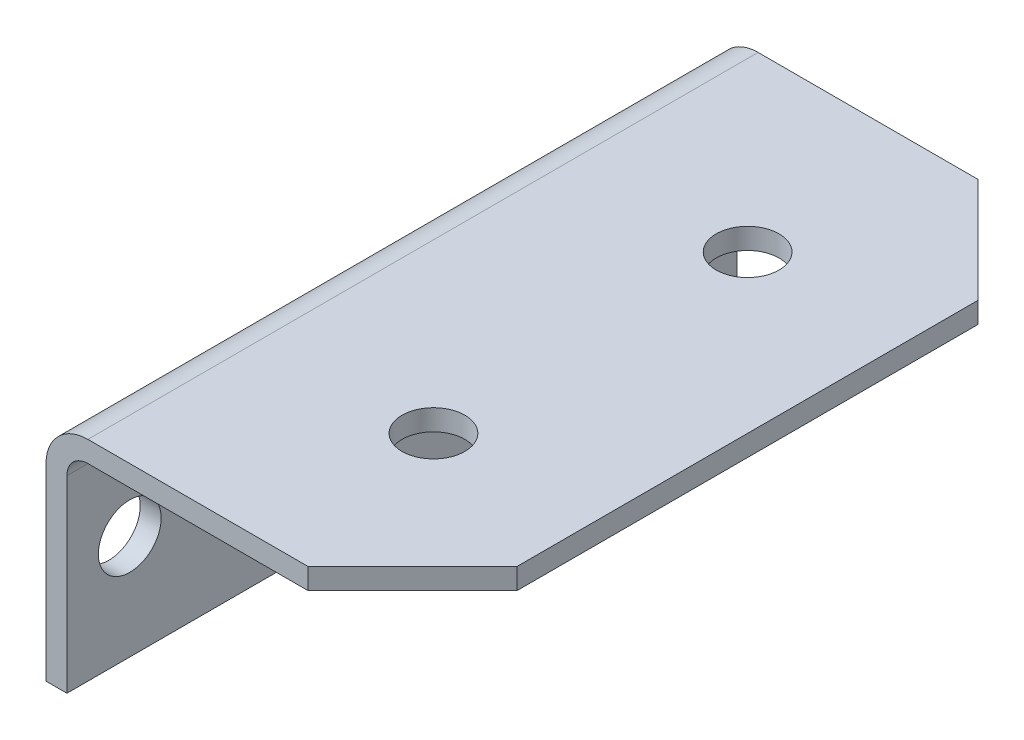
from build123d import *

# Parameters (mm, degrees)
EXTRUSION1_DEPTH        = 64
CONG_1_R                = 2
CONG_2_R                = 4
ESQUISSE2_R             = 3
ENL_V_MAT_EXTRU_1_DEPTH = 10
ESQUISSE3_R             = 3
ENL_V_MAT_EXTRU_2_DEPTH = 10
CHANFREIN1_SIZE         = 10


with BuildPart() as part:
    # Esquisse1 → Extrusion1 (new body)
    with BuildSketch(Plane.XY):
        Polygon((0, 0), (0, 22), (35, 22), (35, 20), (2, 20), (2, 0), align=None)
    extrude(amount=EXTRUSION1_DEPTH)

    # Cong_1
    cong_1_edges = [part.edges().sort_by_distance(p)[0] for p in [
        (2, 20, 32),
    ]]
    fillet(cong_1_edges, radius=CONG_1_R)

    # Cong_2
    cong_2_edges = [part.edges().sort_by_distance(p)[0] for p in [
        (0, 22, 32),
    ]]
    fillet(cong_2_edges, radius=CONG_2_R)

    # Esquisse2 → Enl_v. mat.-Extru.1 (cut)
    with BuildSketch(Plane(origin=(2, 0, 0), x_dir=(0, 0, -1), z_dir=(1, 0, 0))):
        with Locations(Location((-58, 10, 0), (0, 0, 90))):
            Circle(ESQUISSE2_R)
        with Locations(Location((-6, 10, 0), (0, 0, 90))):
            Circle(ESQUISSE2_R)
    extrude(amount=-ENL_V_MAT_EXTRU_1_DEPTH, mode=Mode.SUBTRACT)

    # Esquisse3 → Enl_v. mat.-Extru.2 (cut)
    with BuildSketch(Plane(origin=(0, 22, 0), x_dir=(-1, 0, 0), z_dir=(0, 1, 0))):
        with Locations(Location((-20, 17, 0), (0, 0, 90))):
            Circle(ESQUISSE3_R)
        with Locations(Location((-20, 47, 0), (0, 0, 90))):
            Circle(ESQUISSE3_R)
    extrude(amount=-ENL_V_MAT_EXTRU_2_DEPTH, mode=Mode.SUBTRACT)

    # Chanfrein1
    chanfrein1_edges = [part.edges().sort_by_distance(p)[0] for p in [
        (35, 21, 64),
        (35, 21, 0),
    ]]
    chamfer(chanfrein1_edges, length=CHANFREIN1_SIZE)


solid = part.part
